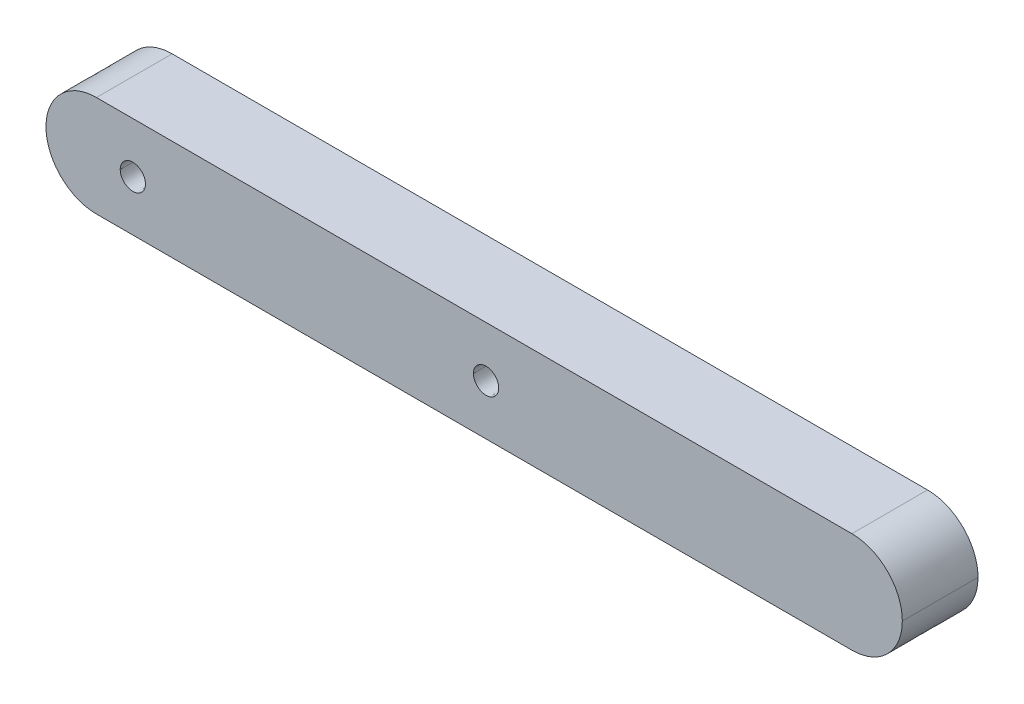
ISO-10303-21;
HEADER;
FILE_DESCRIPTION(('STEP AP214'),'2;1');
FILE_NAME('part.step','',(''),(''),'','','');
FILE_SCHEMA(('AUTOMOTIVE_DESIGN { 1 0 10303 214 1 1 1 1 }'));
ENDSEC;
DATA;
#1=APPLICATION_CONTEXT('core data for automotive mechanical design processes');
#2=APPLICATION_PROTOCOL_DEFINITION('international standard','automotive_design',2000,#1);
#3=PRODUCT_CONTEXT('',#1,'mechanical');
#4=PRODUCT('Part','Part','',(#3));
#5=PRODUCT_RELATED_PRODUCT_CATEGORY('part','',(#4));
#6=PRODUCT_DEFINITION_FORMATION('','',#4);
#7=PRODUCT_DEFINITION_CONTEXT('part definition',#1,'design');
#8=PRODUCT_DEFINITION('design','',#6,#7);
#9=PRODUCT_DEFINITION_SHAPE('','',#8);
#10=(LENGTH_UNIT() NAMED_UNIT(*) SI_UNIT(.MILLI.,.METRE.));
#11=(NAMED_UNIT(*) PLANE_ANGLE_UNIT() SI_UNIT($,.RADIAN.));
#12=(NAMED_UNIT(*) SI_UNIT($,.STERADIAN.) SOLID_ANGLE_UNIT());
#13=UNCERTAINTY_MEASURE_WITH_UNIT(LENGTH_MEASURE(1.E-05),#10,'distance_accuracy_value','');
#14=(GEOMETRIC_REPRESENTATION_CONTEXT(3) GLOBAL_UNCERTAINTY_ASSIGNED_CONTEXT((#13)) GLOBAL_UNIT_ASSIGNED_CONTEXT((#10,
#11,#12)) REPRESENTATION_CONTEXT('',''));
#15=CARTESIAN_POINT('',(0.,0.,0.));
#16=DIRECTION('',(0.,0.,1.));
#17=DIRECTION('',(1.,0.,0.));
#18=AXIS2_PLACEMENT_3D('',#15,#16,#17);
#19=CARTESIAN_POINT('',(2408.6924740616,113.283831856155,6.));
#20=CARTESIAN_POINT('',(2408.69247403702,111.074695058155,6.));
#21=CARTESIAN_POINT('',(2406.90161480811,109.283835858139,6.));
#22=CARTESIAN_POINT('',(2404.69247801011,109.283835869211,6.));
#23=B_SPLINE_CURVE_WITH_KNOTS('',3,(#19,#20,#21,#22),.UNSPECIFIED.,.F.,.F.,(4,4),(7.,8.),.UNSPECIFIED.);
#24=DIRECTION('',(0.,0.,-1.));
#25=VECTOR('',#24,1.);
#26=SURFACE_OF_LINEAR_EXTRUSION('',#23,#25);
#27=CARTESIAN_POINT('',(2408.6924740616,113.283831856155,0.));
#28=CARTESIAN_POINT('',(2408.69247403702,111.074695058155,0.));
#29=CARTESIAN_POINT('',(2406.90161480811,109.283835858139,0.));
#30=CARTESIAN_POINT('',(2404.69247801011,109.283835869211,0.));
#31=B_SPLINE_CURVE_WITH_KNOTS('',3,(#27,#28,#29,#30),.UNSPECIFIED.,.F.,.F.,(4,4),(7.,8.),.UNSPECIFIED.);
#32=CARTESIAN_POINT('',(2408.6924740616,113.283831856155,0.));
#33=VERTEX_POINT('',#32);
#34=CARTESIAN_POINT('',(2404.69247801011,109.283835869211,0.));
#35=VERTEX_POINT('',#34);
#36=EDGE_CURVE('E238',#33,#35,#31,.T.);
#37=ORIENTED_EDGE('',*,*,#36,.F.);
#38=DIRECTION('',(0.,0.,-1.));
#39=VECTOR('',#38,1.);
#40=CARTESIAN_POINT('',(2408.6924740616,113.283831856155,6.));
#41=LINE('',#40,#39);
#42=CARTESIAN_POINT('',(2408.6924740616,113.283831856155,6.));
#43=VERTEX_POINT('',#42);
#44=EDGE_CURVE('E11',#43,#33,#41,.T.);
#45=ORIENTED_EDGE('',*,*,#44,.F.);
#46=CARTESIAN_POINT('',(2404.69247801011,109.283835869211,6.));
#47=VERTEX_POINT('',#46);
#48=EDGE_CURVE('E184',#43,#47,#23,.T.);
#49=ORIENTED_EDGE('',*,*,#48,.T.);
#50=DIRECTION('',(0.,0.,-1.));
#51=VECTOR('',#50,1.);
#52=CARTESIAN_POINT('',(2404.69247801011,109.283835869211,6.));
#53=LINE('',#52,#51);
#54=EDGE_CURVE('E56',#47,#35,#53,.T.);
#55=ORIENTED_EDGE('',*,*,#54,.T.);
#56=EDGE_LOOP('',(#37,#45,#49,#55));
#57=FACE_BOUND('',#56,.T.);
#58=ADVANCED_FACE('F36',(#57),#26,.T.);
#59=CARTESIAN_POINT('',(2404.69247804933,117.283835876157,6.));
#60=CARTESIAN_POINT('',(2406.90161484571,117.283835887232,6.));
#61=CARTESIAN_POINT('',(2408.69247406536,115.492976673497,6.));
#62=CARTESIAN_POINT('',(2408.6924740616,113.283831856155,6.));
#63=B_SPLINE_CURVE_WITH_KNOTS('',3,(#59,#60,#61,#62),.UNSPECIFIED.,.F.,.F.,(4,4),(5.,6.),.UNSPECIFIED.);
#64=DIRECTION('',(0.,0.,-1.));
#65=VECTOR('',#64,1.);
#66=SURFACE_OF_LINEAR_EXTRUSION('',#63,#65);
#67=CARTESIAN_POINT('',(2404.69247804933,117.283835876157,0.));
#68=CARTESIAN_POINT('',(2406.90161484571,117.283835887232,0.));
#69=CARTESIAN_POINT('',(2408.69247406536,115.492976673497,0.));
#70=CARTESIAN_POINT('',(2408.6924740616,113.283831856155,0.));
#71=B_SPLINE_CURVE_WITH_KNOTS('',3,(#67,#68,#69,#70),.UNSPECIFIED.,.F.,.F.,(4,4),(5.,6.),.UNSPECIFIED.);
#72=CARTESIAN_POINT('',(2404.69247804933,117.283835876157,0.));
#73=VERTEX_POINT('',#72);
#74=EDGE_CURVE('E245',#73,#33,#71,.T.);
#75=ORIENTED_EDGE('',*,*,#74,.F.);
#76=DIRECTION('',(0.,0.,-1.));
#77=VECTOR('',#76,1.);
#78=CARTESIAN_POINT('',(2404.69247804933,117.283835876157,6.));
#79=LINE('',#78,#77);
#80=CARTESIAN_POINT('',(2404.69247804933,117.283835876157,6.));
#81=VERTEX_POINT('',#80);
#82=EDGE_CURVE('E47',#81,#73,#79,.T.);
#83=ORIENTED_EDGE('',*,*,#82,.F.);
#84=EDGE_CURVE('E179',#81,#43,#63,.T.);
#85=ORIENTED_EDGE('',*,*,#84,.T.);
#86=ORIENTED_EDGE('',*,*,#44,.T.);
#87=EDGE_LOOP('',(#75,#83,#85,#86));
#88=FACE_BOUND('',#87,.T.);
#89=ADVANCED_FACE('F171',(#88),#66,.T.);
#90=CARTESIAN_POINT('',(0.,117.283835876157,6.));
#91=DIRECTION('',(0.,1.,0.));
#92=DIRECTION('',(0.,0.,1.));
#93=AXIS2_PLACEMENT_3D('',#90,#91,#92);
#94=PLANE('',#93);
#95=DIRECTION('',(1.,0.,0.));
#96=VECTOR('',#95,1.);
#97=CARTESIAN_POINT('',(0.,117.283835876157,0.));
#98=LINE('',#97,#96);
#99=CARTESIAN_POINT('',(2344.80913671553,117.283835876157,0.));
#100=VERTEX_POINT('',#99);
#101=EDGE_CURVE('E195',#100,#73,#98,.T.);
#102=ORIENTED_EDGE('',*,*,#101,.F.);
#103=DIRECTION('',(0.,0.,-1.));
#104=VECTOR('',#103,1.);
#105=CARTESIAN_POINT('',(2344.80913671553,117.283835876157,6.));
#106=LINE('',#105,#104);
#107=CARTESIAN_POINT('',(2344.80913671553,117.283835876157,6.));
#108=VERTEX_POINT('',#107);
#109=EDGE_CURVE('E130',#108,#100,#106,.T.);
#110=ORIENTED_EDGE('',*,*,#109,.F.);
#111=DIRECTION('',(1.,0.,0.));
#112=VECTOR('',#111,1.);
#113=CARTESIAN_POINT('',(0.,117.283835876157,6.));
#114=LINE('',#113,#112);
#115=EDGE_CURVE('E141',#108,#81,#114,.T.);
#116=ORIENTED_EDGE('',*,*,#115,.T.);
#117=ORIENTED_EDGE('',*,*,#82,.T.);
#118=EDGE_LOOP('',(#102,#110,#116,#117));
#119=FACE_BOUND('',#118,.T.);
#120=ADVANCED_FACE('F168',(#119),#94,.T.);
#121=CARTESIAN_POINT('',(2340.8091407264,113.283838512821,6.));
#122=CARTESIAN_POINT('',(2340.80913996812,115.492975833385,6.));
#123=CARTESIAN_POINT('',(2342.59999939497,117.283835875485,6.));
#124=CARTESIAN_POINT('',(2344.80913671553,117.283835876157,6.));
#125=B_SPLINE_CURVE_WITH_KNOTS('',3,(#121,#122,#123,#124),.UNSPECIFIED.,.F.,.F.,(4,4),(3.,4.),.UNSPECIFIED.);
#126=DIRECTION('',(0.,0.,-1.));
#127=VECTOR('',#126,1.);
#128=SURFACE_OF_LINEAR_EXTRUSION('',#125,#127);
#129=CARTESIAN_POINT('',(2340.8091407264,113.283838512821,0.));
#130=CARTESIAN_POINT('',(2340.80913996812,115.492975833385,0.));
#131=CARTESIAN_POINT('',(2342.59999939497,117.283835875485,0.));
#132=CARTESIAN_POINT('',(2344.80913671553,117.283835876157,0.));
#133=B_SPLINE_CURVE_WITH_KNOTS('',3,(#129,#130,#131,#132),.UNSPECIFIED.,.F.,.F.,(4,4),(3.,4.),.UNSPECIFIED.);
#134=CARTESIAN_POINT('',(2340.8091407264,113.283838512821,0.));
#135=VERTEX_POINT('',#134);
#136=EDGE_CURVE('E126',#135,#100,#133,.T.);
#137=ORIENTED_EDGE('',*,*,#136,.F.);
#138=DIRECTION('',(0.,0.,-1.));
#139=VECTOR('',#138,1.);
#140=CARTESIAN_POINT('',(2340.8091407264,113.283838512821,6.));
#141=LINE('',#140,#139);
#142=CARTESIAN_POINT('',(2340.8091407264,113.283838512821,6.));
#143=VERTEX_POINT('',#142);
#144=EDGE_CURVE('E121',#143,#135,#141,.T.);
#145=ORIENTED_EDGE('',*,*,#144,.F.);
#146=EDGE_CURVE('E124',#143,#108,#125,.T.);
#147=ORIENTED_EDGE('',*,*,#146,.T.);
#148=ORIENTED_EDGE('',*,*,#109,.T.);
#149=EDGE_LOOP('',(#137,#145,#147,#148));
#150=FACE_BOUND('',#149,.T.);
#151=ADVANCED_FACE('F123',(#150),#128,.T.);
#152=CARTESIAN_POINT('',(2344.80913669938,109.283835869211,6.));
#153=CARTESIAN_POINT('',(2342.60000046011,109.283835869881,6.));
#154=CARTESIAN_POINT('',(2340.80914148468,111.074694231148,6.));
#155=CARTESIAN_POINT('',(2340.8091407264,113.283838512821,6.));
#156=B_SPLINE_CURVE_WITH_KNOTS('',3,(#152,#153,#154,#155),.UNSPECIFIED.,.F.,.F.,(4,4),(1.,2.),.UNSPECIFIED.);
#157=DIRECTION('',(0.,0.,-1.));
#158=VECTOR('',#157,1.);
#159=SURFACE_OF_LINEAR_EXTRUSION('',#156,#158);
#160=CARTESIAN_POINT('',(2344.80913669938,109.283835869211,0.));
#161=CARTESIAN_POINT('',(2342.60000046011,109.283835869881,0.));
#162=CARTESIAN_POINT('',(2340.80914148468,111.074694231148,0.));
#163=CARTESIAN_POINT('',(2340.8091407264,113.283838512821,0.));
#164=B_SPLINE_CURVE_WITH_KNOTS('',3,(#160,#161,#162,#163),.UNSPECIFIED.,.F.,.F.,(4,4),(1.,2.),.UNSPECIFIED.);
#165=CARTESIAN_POINT('',(2344.80913669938,109.283835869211,0.));
#166=VERTEX_POINT('',#165);
#167=EDGE_CURVE('E260',#166,#135,#164,.T.);
#168=ORIENTED_EDGE('',*,*,#167,.F.);
#169=DIRECTION('',(0.,0.,-1.));
#170=VECTOR('',#169,1.);
#171=CARTESIAN_POINT('',(2344.80913669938,109.283835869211,6.));
#172=LINE('',#171,#170);
#173=CARTESIAN_POINT('',(2344.80913669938,109.283835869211,6.));
#174=VERTEX_POINT('',#173);
#175=EDGE_CURVE('E87',#174,#166,#172,.T.);
#176=ORIENTED_EDGE('',*,*,#175,.F.);
#177=EDGE_CURVE('E138',#174,#143,#156,.T.);
#178=ORIENTED_EDGE('',*,*,#177,.T.);
#179=ORIENTED_EDGE('',*,*,#144,.T.);
#180=EDGE_LOOP('',(#168,#176,#178,#179));
#181=FACE_BOUND('',#180,.T.);
#182=ADVANCED_FACE('F143',(#181),#159,.T.);
#183=CARTESIAN_POINT('',(2348.69247405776,113.283835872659,6.));
#184=CARTESIAN_POINT('',(2348.69247405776,113.836120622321,6.));
#185=CARTESIAN_POINT('',(2348.24475880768,114.28383587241,6.));
#186=CARTESIAN_POINT('',(2347.14018930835,114.28383587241,6.));
#187=CARTESIAN_POINT('',(2346.69247405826,113.836120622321,6.));
#188=CARTESIAN_POINT('',(2346.69247405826,113.283835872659,6.));
#189=B_SPLINE_CURVE_WITH_KNOTS('',3,(#183,#184,#185,#186,#187,#188),.UNSPECIFIED.,.F.,.F.,(4,2,
4),(0.,1.,2.),.UNSPECIFIED.);
#190=DIRECTION('',(0.,0.,-1.));
#191=VECTOR('',#190,1.);
#192=SURFACE_OF_LINEAR_EXTRUSION('',#189,#191);
#193=CARTESIAN_POINT('',(2348.69247405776,113.283835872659,0.));
#194=CARTESIAN_POINT('',(2348.69247405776,113.836120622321,0.));
#195=CARTESIAN_POINT('',(2348.24475880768,114.28383587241,0.));
#196=CARTESIAN_POINT('',(2347.14018930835,114.28383587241,0.));
#197=CARTESIAN_POINT('',(2346.69247405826,113.836120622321,0.));
#198=CARTESIAN_POINT('',(2346.69247405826,113.283835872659,0.));
#199=B_SPLINE_CURVE_WITH_KNOTS('',3,(#193,#194,#195,#196,#197,#198),.UNSPECIFIED.,.F.,.F.,(4,2,
4),(0.,1.,2.),.UNSPECIFIED.);
#200=CARTESIAN_POINT('',(2348.69247405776,113.283835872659,0.));
#201=VERTEX_POINT('',#200);
#202=CARTESIAN_POINT('',(2346.69247405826,113.283835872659,0.));
#203=VERTEX_POINT('',#202);
#204=EDGE_CURVE('E216',#201,#203,#199,.T.);
#205=ORIENTED_EDGE('',*,*,#204,.F.);
#206=DIRECTION('',(0.,0.,-1.));
#207=VECTOR('',#206,1.);
#208=CARTESIAN_POINT('',(2348.69247405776,113.283835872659,6.));
#209=LINE('',#208,#207);
#210=CARTESIAN_POINT('',(2348.69247405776,113.283835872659,6.));
#211=VERTEX_POINT('',#210);
#212=EDGE_CURVE('E202',#211,#201,#209,.T.);
#213=ORIENTED_EDGE('',*,*,#212,.F.);
#214=CARTESIAN_POINT('',(2346.69247405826,113.283835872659,6.));
#215=VERTEX_POINT('',#214);
#216=EDGE_CURVE('E275',#211,#215,#189,.T.);
#217=ORIENTED_EDGE('',*,*,#216,.T.);
#218=DIRECTION('',(0.,0.,-1.));
#219=VECTOR('',#218,1.);
#220=CARTESIAN_POINT('',(2346.69247405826,113.283835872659,6.));
#221=LINE('',#220,#219);
#222=EDGE_CURVE('E200',#215,#203,#221,.T.);
#223=ORIENTED_EDGE('',*,*,#222,.T.);
#224=EDGE_LOOP('',(#205,#213,#217,#223));
#225=FACE_BOUND('',#224,.T.);
#226=ADVANCED_FACE('F163',(#225),#192,.T.);
#227=CARTESIAN_POINT('',(2376.69247405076,113.283835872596,6.));
#228=CARTESIAN_POINT('',(2376.69247405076,113.836120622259,6.));
#229=CARTESIAN_POINT('',(2376.24475880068,114.283835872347,6.));
#230=CARTESIAN_POINT('',(2375.14018930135,114.283835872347,6.));
#231=CARTESIAN_POINT('',(2374.69247405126,113.836120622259,6.));
#232=CARTESIAN_POINT('',(2374.69247405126,113.283835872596,6.));
#233=B_SPLINE_CURVE_WITH_KNOTS('',3,(#227,#228,#229,#230,#231,#232),.UNSPECIFIED.,.F.,.F.,(4,2,
4),(0.,1.,2.),.UNSPECIFIED.);
#234=DIRECTION('',(0.,0.,-1.));
#235=VECTOR('',#234,1.);
#236=SURFACE_OF_LINEAR_EXTRUSION('',#233,#235);
#237=CARTESIAN_POINT('',(2376.69247405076,113.283835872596,0.));
#238=CARTESIAN_POINT('',(2376.69247405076,113.836120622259,0.));
#239=CARTESIAN_POINT('',(2376.24475880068,114.283835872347,0.));
#240=CARTESIAN_POINT('',(2375.14018930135,114.283835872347,0.));
#241=CARTESIAN_POINT('',(2374.69247405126,113.836120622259,0.));
#242=CARTESIAN_POINT('',(2374.69247405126,113.283835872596,0.));
#243=B_SPLINE_CURVE_WITH_KNOTS('',3,(#237,#238,#239,#240,#241,#242),.UNSPECIFIED.,.F.,.F.,(4,2,
4),(0.,1.,2.),.UNSPECIFIED.);
#244=CARTESIAN_POINT('',(2376.69247405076,113.283835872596,0.));
#245=VERTEX_POINT('',#244);
#246=CARTESIAN_POINT('',(2374.69247405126,113.283835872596,0.));
#247=VERTEX_POINT('',#246);
#248=EDGE_CURVE('E212',#245,#247,#243,.T.);
#249=ORIENTED_EDGE('',*,*,#248,.F.);
#250=DIRECTION('',(0.,0.,-1.));
#251=VECTOR('',#250,1.);
#252=CARTESIAN_POINT('',(2376.69247405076,113.283835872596,6.));
#253=LINE('',#252,#251);
#254=CARTESIAN_POINT('',(2376.69247405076,113.283835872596,6.));
#255=VERTEX_POINT('',#254);
#256=EDGE_CURVE('E41',#255,#245,#253,.T.);
#257=ORIENTED_EDGE('',*,*,#256,.F.);
#258=CARTESIAN_POINT('',(2374.69247405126,113.283835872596,6.));
#259=VERTEX_POINT('',#258);
#260=EDGE_CURVE('E273',#255,#259,#233,.T.);
#261=ORIENTED_EDGE('',*,*,#260,.T.);
#262=DIRECTION('',(0.,0.,-1.));
#263=VECTOR('',#262,1.);
#264=CARTESIAN_POINT('',(2374.69247405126,113.283835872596,6.));
#265=LINE('',#264,#263);
#266=EDGE_CURVE('E146',#259,#247,#265,.T.);
#267=ORIENTED_EDGE('',*,*,#266,.T.);
#268=EDGE_LOOP('',(#249,#257,#261,#267));
#269=FACE_BOUND('',#268,.T.);
#270=ADVANCED_FACE('F38',(#269),#236,.T.);
#271=CARTESIAN_POINT('',(2346.69247405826,113.283835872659,6.));
#272=CARTESIAN_POINT('',(2346.69247405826,112.731551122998,6.));
#273=CARTESIAN_POINT('',(2347.14018930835,112.28383587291,6.));
#274=CARTESIAN_POINT('',(2348.24475880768,112.28383587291,6.));
#275=CARTESIAN_POINT('',(2348.69247405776,112.731551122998,6.));
#276=CARTESIAN_POINT('',(2348.69247405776,113.283835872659,6.));
#277=B_SPLINE_CURVE_WITH_KNOTS('',3,(#271,#272,#273,#274,#275,#276),.UNSPECIFIED.,.F.,.F.,(4,2,
4),(2.,3.,4.),.UNSPECIFIED.);
#278=DIRECTION('',(0.,0.,-1.));
#279=VECTOR('',#278,1.);
#280=SURFACE_OF_LINEAR_EXTRUSION('',#277,#279);
#281=CARTESIAN_POINT('',(2346.69247405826,113.283835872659,0.));
#282=CARTESIAN_POINT('',(2346.69247405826,112.731551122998,0.));
#283=CARTESIAN_POINT('',(2347.14018930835,112.28383587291,0.));
#284=CARTESIAN_POINT('',(2348.24475880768,112.28383587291,0.));
#285=CARTESIAN_POINT('',(2348.69247405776,112.731551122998,0.));
#286=CARTESIAN_POINT('',(2348.69247405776,113.283835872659,0.));
#287=B_SPLINE_CURVE_WITH_KNOTS('',3,(#281,#282,#283,#284,#285,#286),.UNSPECIFIED.,.F.,.F.,(4,2,
4),(2.,3.,4.),.UNSPECIFIED.);
#288=EDGE_CURVE('E219',#203,#201,#287,.T.);
#289=ORIENTED_EDGE('',*,*,#288,.F.);
#290=ORIENTED_EDGE('',*,*,#222,.F.);
#291=EDGE_CURVE('E300',#215,#211,#277,.T.);
#292=ORIENTED_EDGE('',*,*,#291,.T.);
#293=ORIENTED_EDGE('',*,*,#212,.T.);
#294=EDGE_LOOP('',(#289,#290,#292,#293));
#295=FACE_BOUND('',#294,.T.);
#296=ADVANCED_FACE('F295',(#295),#280,.T.);
#297=CARTESIAN_POINT('',(2374.69247405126,113.283835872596,6.));
#298=CARTESIAN_POINT('',(2374.69247405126,112.731551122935,6.));
#299=CARTESIAN_POINT('',(2375.14018930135,112.283835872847,6.));
#300=CARTESIAN_POINT('',(2376.24475880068,112.283835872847,6.));
#301=CARTESIAN_POINT('',(2376.69247405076,112.731551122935,6.));
#302=CARTESIAN_POINT('',(2376.69247405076,113.283835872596,6.));
#303=B_SPLINE_CURVE_WITH_KNOTS('',3,(#297,#298,#299,#300,#301,#302),.UNSPECIFIED.,.F.,.F.,(4,2,
4),(2.,3.,4.),.UNSPECIFIED.);
#304=DIRECTION('',(0.,0.,-1.));
#305=VECTOR('',#304,1.);
#306=SURFACE_OF_LINEAR_EXTRUSION('',#303,#305);
#307=CARTESIAN_POINT('',(2374.69247405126,113.283835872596,0.));
#308=CARTESIAN_POINT('',(2374.69247405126,112.731551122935,0.));
#309=CARTESIAN_POINT('',(2375.14018930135,112.283835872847,0.));
#310=CARTESIAN_POINT('',(2376.24475880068,112.283835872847,0.));
#311=CARTESIAN_POINT('',(2376.69247405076,112.731551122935,0.));
#312=CARTESIAN_POINT('',(2376.69247405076,113.283835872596,0.));
#313=B_SPLINE_CURVE_WITH_KNOTS('',3,(#307,#308,#309,#310,#311,#312),.UNSPECIFIED.,.F.,.F.,(4,2,
4),(2.,3.,4.),.UNSPECIFIED.);
#314=EDGE_CURVE('E209',#247,#245,#313,.T.);
#315=ORIENTED_EDGE('',*,*,#314,.F.);
#316=ORIENTED_EDGE('',*,*,#266,.F.);
#317=EDGE_CURVE('E211',#259,#255,#303,.T.);
#318=ORIENTED_EDGE('',*,*,#317,.T.);
#319=ORIENTED_EDGE('',*,*,#256,.T.);
#320=EDGE_LOOP('',(#315,#316,#318,#319));
#321=FACE_BOUND('',#320,.T.);
#322=ADVANCED_FACE('F207',(#321),#306,.T.);
#323=CARTESIAN_POINT('',(0.,109.283835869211,6.));
#324=DIRECTION('',(0.,-1.,0.));
#325=DIRECTION('',(0.,0.,-1.));
#326=AXIS2_PLACEMENT_3D('',#323,#324,#325);
#327=PLANE('',#326);
#328=DIRECTION('',(-1.,0.,0.));
#329=VECTOR('',#328,1.);
#330=CARTESIAN_POINT('',(0.,109.283835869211,0.));
#331=LINE('',#330,#329);
#332=EDGE_CURVE('E267',#35,#166,#331,.T.);
#333=ORIENTED_EDGE('',*,*,#332,.F.);
#334=ORIENTED_EDGE('',*,*,#54,.F.);
#335=DIRECTION('',(-1.,0.,0.));
#336=VECTOR('',#335,1.);
#337=CARTESIAN_POINT('',(0.,109.283835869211,6.));
#338=LINE('',#337,#336);
#339=EDGE_CURVE('E144',#47,#174,#338,.T.);
#340=ORIENTED_EDGE('',*,*,#339,.T.);
#341=ORIENTED_EDGE('',*,*,#175,.T.);
#342=EDGE_LOOP('',(#333,#334,#340,#341));
#343=FACE_BOUND('',#342,.T.);
#344=ADVANCED_FACE('F164',(#343),#327,.T.);
#345=CARTESIAN_POINT('',(0.,0.,6.));
#346=DIRECTION('',(0.,0.,1.));
#347=DIRECTION('',(1.,0.,0.));
#348=AXIS2_PLACEMENT_3D('',#345,#346,#347);
#349=PLANE('',#348);
#350=ORIENTED_EDGE('',*,*,#260,.F.);
#351=ORIENTED_EDGE('',*,*,#317,.F.);
#352=EDGE_LOOP('',(#350,#351));
#353=FACE_BOUND('',#352,.T.);
#354=ORIENTED_EDGE('',*,*,#216,.F.);
#355=ORIENTED_EDGE('',*,*,#291,.F.);
#356=EDGE_LOOP('',(#354,#355));
#357=FACE_BOUND('',#356,.T.);
#358=ORIENTED_EDGE('',*,*,#48,.F.);
#359=ORIENTED_EDGE('',*,*,#84,.F.);
#360=ORIENTED_EDGE('',*,*,#115,.F.);
#361=ORIENTED_EDGE('',*,*,#146,.F.);
#362=ORIENTED_EDGE('',*,*,#177,.F.);
#363=ORIENTED_EDGE('',*,*,#339,.F.);
#364=EDGE_LOOP('',(#358,#359,#360,#361,#362,#363));
#365=FACE_BOUND('',#364,.T.);
#366=ADVANCED_FACE('F136',(#353,#357,#365),#349,.T.);
#367=CARTESIAN_POINT('',(0.,0.,0.));
#368=DIRECTION('',(0.,0.,1.));
#369=DIRECTION('',(1.,0.,0.));
#370=AXIS2_PLACEMENT_3D('',#367,#368,#369);
#371=PLANE('',#370);
#372=ORIENTED_EDGE('',*,*,#248,.T.);
#373=ORIENTED_EDGE('',*,*,#314,.T.);
#374=EDGE_LOOP('',(#372,#373));
#375=FACE_BOUND('',#374,.T.);
#376=ORIENTED_EDGE('',*,*,#204,.T.);
#377=ORIENTED_EDGE('',*,*,#288,.T.);
#378=EDGE_LOOP('',(#376,#377));
#379=FACE_BOUND('',#378,.T.);
#380=ORIENTED_EDGE('',*,*,#36,.T.);
#381=ORIENTED_EDGE('',*,*,#332,.T.);
#382=ORIENTED_EDGE('',*,*,#167,.T.);
#383=ORIENTED_EDGE('',*,*,#136,.T.);
#384=ORIENTED_EDGE('',*,*,#101,.T.);
#385=ORIENTED_EDGE('',*,*,#74,.T.);
#386=EDGE_LOOP('',(#380,#381,#382,#383,#384,#385));
#387=FACE_BOUND('',#386,.T.);
#388=ADVANCED_FACE('F214',(#375,#379,#387),#371,.F.);
#389=CLOSED_SHELL('',(#58,#89,#120,#151,#182,#226,#270,#296,#322,#344,#366,#388));
#390=MANIFOLD_SOLID_BREP('B2',#389);
#391=ADVANCED_BREP_SHAPE_REPRESENTATION('',(#18,#390),#14);
#392=SHAPE_DEFINITION_REPRESENTATION(#9,#391);
ENDSEC;
END-ISO-10303-21;
